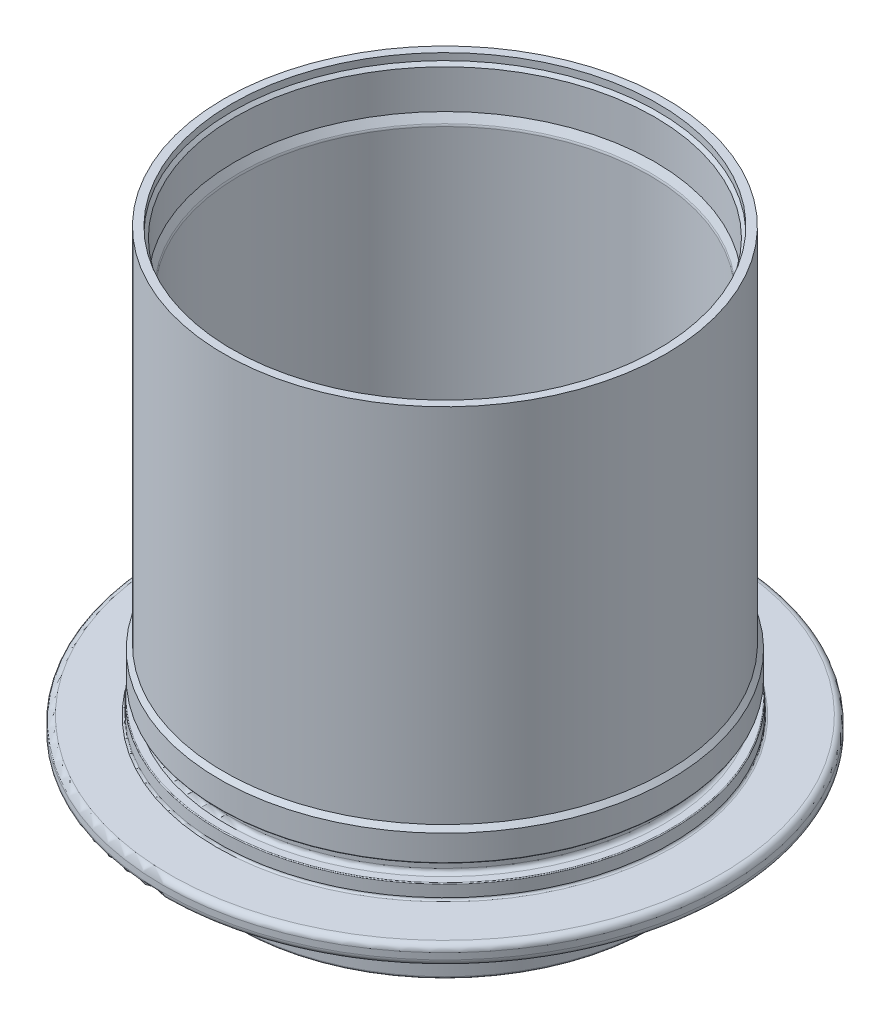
from build123d import *

# Parameters (mm, degrees)
ESQUISSE6_R        = 52.95
ESQUISSE6_R_2      = 51
BOSS_EXTRU_1_DEPTH = 90


with BuildPart() as part:
    # Esquisse1 → R_volution1 (revolve)
    with BuildSketch(Plane.XY):
        with BuildLine():
            Line((-120.256684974, 137.386860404), (-120.256684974, 54.629466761))
            ThreePointArc((-120.256684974, 54.629466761), (-119.343239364, 50.037265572), (-116.741966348, 46.144185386))
            Line((-116.741966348, 46.144185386), (-111.064578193, 40.466797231))
            ThreePointArc((-111.064578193, 40.466797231), (-110.847805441, 40.142373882), (-110.771684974, 39.75969045))
            Line((-110.771684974, 39.75969045), (-110.771684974, 39.273957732))
            ThreePointArc((-110.771684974, 39.273957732), (-110.888842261, 38.99111502), (-111.171684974, 38.873957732))
            Line((-111.171684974, 38.873957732), (-113.496714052, 38.873957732))
            ThreePointArc((-113.496714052, 38.873957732), (-114.557374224, 38.434617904), (-114.996714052, 37.373957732))
            Line((-114.996714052, 37.373957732), (-114.996714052, 34.373957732))
            ThreePointArc((-114.996714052, 34.373957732), (-114.557374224, 33.31329756), (-113.496714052, 32.873957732))
            Line((-113.496714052, 32.873957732), (-110.521684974, 32.873957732))
            ThreePointArc((-110.521684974, 32.873957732), (-110.238842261, 32.756800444), (-110.121684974, 32.473957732))
            Line((-110.121684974, 32.473957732), (-110.121684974, 31.641948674))
            ThreePointArc((-110.121684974, 31.641948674), (-110.155759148, 31.383129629), (-110.25565957, 31.141948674))
            Line((-110.25565957, 31.141948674), (-110.699059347, 30.373957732))
            Line((-110.699059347, 30.373957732), (-120.471684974, 30.373957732))
            ThreePointArc((-120.471684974, 30.373957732), (-120.825238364, 30.520404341), (-120.971684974, 30.873957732))
            Line((-120.971684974, 30.873957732), (-120.971684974, 34.585843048))
            ThreePointArc((-120.971684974, 34.585843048), (-120.920573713, 34.974071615), (-120.77072308, 35.335843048))
            Line((-120.77072308, 35.335843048), (-119.272646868, 37.930587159))
            ThreePointArc((-119.272646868, 37.930587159), (-119.122796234, 38.292358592), (-119.071684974, 38.680587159))
            Line((-119.071684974, 38.680587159), (-119.071684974, 40.876739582))
            ThreePointArc((-119.071684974, 40.876739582), (-119.122796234, 41.26496815), (-119.272646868, 41.626739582))
            Line((-119.272646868, 41.626739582), (-121.003091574, 44.623957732))
            ThreePointArc((-121.003091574, 44.623957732), (-121.55212968, 45.172995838), (-122.30212968, 45.373957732))
            Line((-122.30212968, 45.373957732), (-137.171684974, 45.373957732))
            ThreePointArc((-137.171684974, 45.373957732), (-138.232345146, 45.81329756), (-138.671684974, 46.873957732))
            Line((-138.671684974, 46.873957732), (-138.671684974, 48.373957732))
            ThreePointArc((-138.671684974, 48.373957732), (-138.232345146, 49.434617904), (-137.171684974, 49.873957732))
            Line((-137.171684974, 49.873957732), (-125.871684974, 49.873957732))
            ThreePointArc((-125.871684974, 49.873957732), (-125.518131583, 50.020404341), (-125.371684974, 50.373957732))
            Line((-125.371684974, 50.373957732), (-125.371684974, 53.173957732))
            ThreePointArc((-125.371684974, 53.173957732), (-125.31310633, 53.315379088), (-125.171684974, 53.373957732))
            Line((-125.171684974, 53.373957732), (-123.421684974, 53.373957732))
            ThreePointArc((-123.421684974, 53.373957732), (-122.714578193, 53.666850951), (-122.421684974, 54.373957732))
            Line((-122.421684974, 54.373957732), (-122.421684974, 56.323957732))
            ThreePointArc((-122.421684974, 56.323957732), (-122.714578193, 57.031064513), (-123.421684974, 57.323957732))
            Line((-123.421684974, 57.323957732), (-124.971684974, 57.323957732))
            ThreePointArc((-124.971684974, 57.323957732), (-125.11310633, 57.382536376), (-125.171684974, 57.523957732))
            Line((-125.171684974, 57.523957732), (-125.171684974, 63.623963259))
            Line((-125.171684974, 63.623963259), (-123.921684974, 64.873957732))
            Line((-123.921684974, 64.873957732), (-123.921684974, 149.070090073))
            ThreePointArc((-123.921684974, 149.070090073), (-123.819462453, 149.846547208), (-123.519761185, 150.570090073))
            Line((-123.519761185, 150.570090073), (-123.058227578, 151.36948973))
            Line((-123.058227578, 151.36948973), (-122.321684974, 151.365678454))
            Line((-122.321684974, 151.365678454), (-122.321684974, 149.865678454))
            Line((-122.321684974, 149.865678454), (-121.421684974, 148.965678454))
            Line((-121.421684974, 148.965678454), (-121.421684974, 139.672648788))
            Line((-121.421684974, 139.672648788), (-120.39065957, 137.886860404))
            ThreePointArc((-120.39065957, 137.886860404), (-120.290759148, 137.645679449), (-120.256684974, 137.386860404))
        make_face()
    revolve(axis=Axis((-71.171684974, 158.736724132, 0), (0, -1, 0)))

    # Esquisse6 → Boss.-Extru.1 (add)
    with BuildSketch(Plane(origin=(0, 151.373957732, 0), x_dir=(1, 0, 0), z_dir=(0, 1, 0))):
        with Locations(Location((-71.171684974, 0, 0), (0, 0, 180))):
            Circle(ESQUISSE6_R)
        with Locations(Location((-71.171684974, 0, 0), (0, 0, 180))):
            Circle(ESQUISSE6_R_2, mode=Mode.SUBTRACT)
    extrude(amount=-BOSS_EXTRU_1_DEPTH)


solid = part.part
